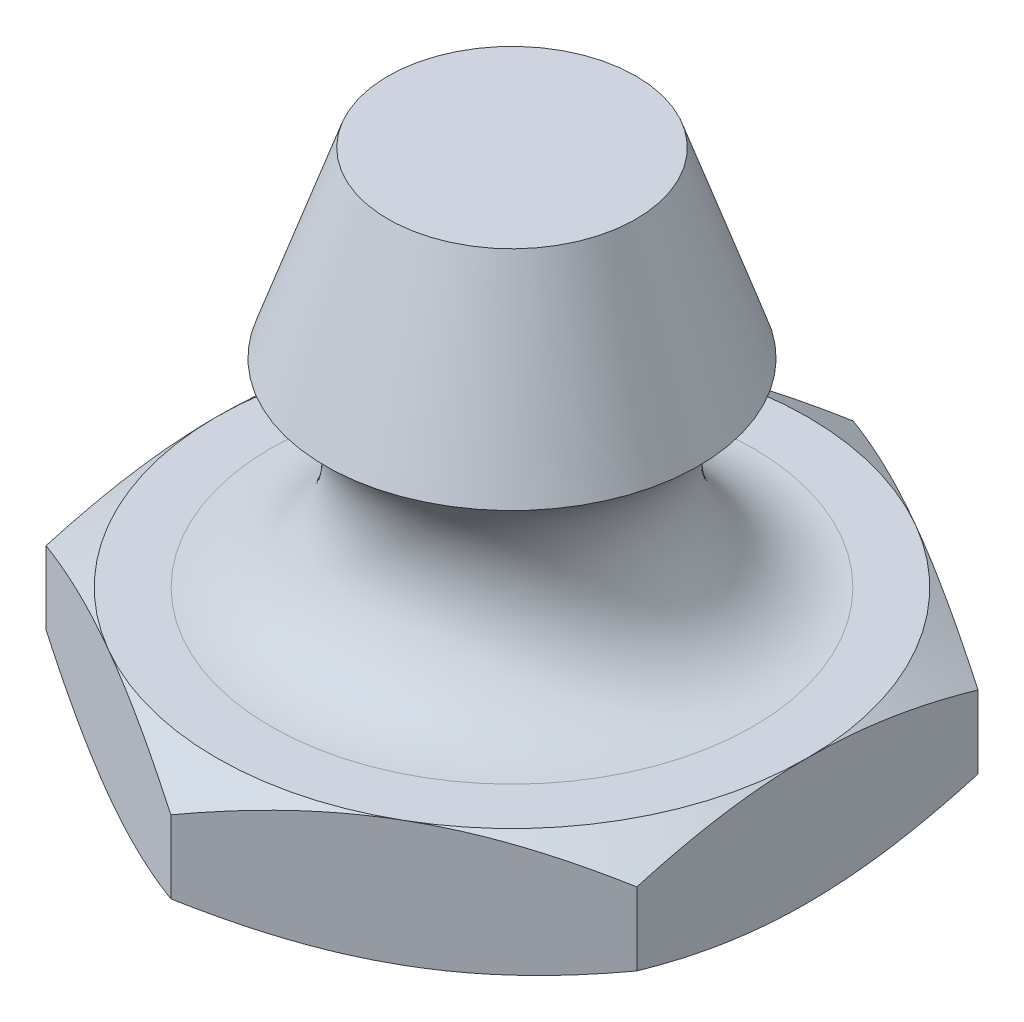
ISO-10303-21;
HEADER;
FILE_DESCRIPTION(('STEP AP214'),'2;1');
FILE_NAME('part.step','',(''),(''),'','','');
FILE_SCHEMA(('AUTOMOTIVE_DESIGN { 1 0 10303 214 1 1 1 1 }'));
ENDSEC;
DATA;
#1=APPLICATION_CONTEXT('core data for automotive mechanical design processes');
#2=APPLICATION_PROTOCOL_DEFINITION('international standard','automotive_design',2000,#1);
#3=PRODUCT_CONTEXT('',#1,'mechanical');
#4=PRODUCT('Part','Part','',(#3));
#5=PRODUCT_RELATED_PRODUCT_CATEGORY('part','',(#4));
#6=PRODUCT_DEFINITION_FORMATION('','',#4);
#7=PRODUCT_DEFINITION_CONTEXT('part definition',#1,'design');
#8=PRODUCT_DEFINITION('design','',#6,#7);
#9=PRODUCT_DEFINITION_SHAPE('','',#8);
#10=(LENGTH_UNIT() NAMED_UNIT(*) SI_UNIT(.MILLI.,.METRE.));
#11=(NAMED_UNIT(*) PLANE_ANGLE_UNIT() SI_UNIT($,.RADIAN.));
#12=(NAMED_UNIT(*) SI_UNIT($,.STERADIAN.) SOLID_ANGLE_UNIT());
#13=UNCERTAINTY_MEASURE_WITH_UNIT(LENGTH_MEASURE(1.E-05),#10,'distance_accuracy_value','');
#14=(GEOMETRIC_REPRESENTATION_CONTEXT(3) GLOBAL_UNCERTAINTY_ASSIGNED_CONTEXT((#13)) GLOBAL_UNIT_ASSIGNED_CONTEXT((#10,
#11,#12)) REPRESENTATION_CONTEXT('',''));
#15=CARTESIAN_POINT('',(0.,0.,0.));
#16=DIRECTION('',(0.,0.,1.));
#17=DIRECTION('',(1.,0.,0.));
#18=AXIS2_PLACEMENT_3D('',#15,#16,#17);
#19=CARTESIAN_POINT('',(-4.53389999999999,2.36220000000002,0.));
#20=DIRECTION('',(0.,1.,0.));
#21=DIRECTION('',(0.,0.,1.));
#22=AXIS2_PLACEMENT_3D('',#19,#20,#21);
#23=PLANE('',#22);
#24=CARTESIAN_POINT('',(0.,2.36220000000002,0.));
#25=DIRECTION('',(0.,1.,0.));
#26=DIRECTION('',(-1.,0.,0.));
#27=AXIS2_PLACEMENT_3D('',#24,#25,#26);
#28=CIRCLE('',#27,5.55625000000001);
#29=CARTESIAN_POINT('',(-5.55625000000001,2.36220000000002,0.));
#30=VERTEX_POINT('',#29);
#31=CARTESIAN_POINT('',(-2.778125,2.36220000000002,4.81185364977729));
#32=VERTEX_POINT('',#31);
#33=EDGE_CURVE('E124',#30,#32,#28,.T.);
#34=ORIENTED_EDGE('',*,*,#33,.T.);
#35=CARTESIAN_POINT('',(0.,2.36220000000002,0.));
#36=DIRECTION('',(0.,1.,0.));
#37=DIRECTION('',(0.,0.,1.));
#38=AXIS2_PLACEMENT_3D('',#35,#36,#37);
#39=CIRCLE('',#38,5.55625000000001);
#40=CARTESIAN_POINT('',(2.77812500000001,2.36220000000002,4.81185364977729));
#41=VERTEX_POINT('',#40);
#42=EDGE_CURVE('E138',#41,#32,#39,.F.);
#43=ORIENTED_EDGE('',*,*,#42,.F.);
#44=CARTESIAN_POINT('',(5.55625000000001,2.36220000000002,0.));
#45=VERTEX_POINT('',#44);
#46=EDGE_CURVE('E144',#45,#41,#39,.F.);
#47=ORIENTED_EDGE('',*,*,#46,.F.);
#48=CARTESIAN_POINT('',(2.77812500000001,2.36220000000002,-4.81185364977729));
#49=VERTEX_POINT('',#48);
#50=EDGE_CURVE('E506',#49,#45,#39,.F.);
#51=ORIENTED_EDGE('',*,*,#50,.F.);
#52=CARTESIAN_POINT('',(-2.778125,2.36220000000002,-4.81185364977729));
#53=VERTEX_POINT('',#52);
#54=EDGE_CURVE('E507',#53,#49,#39,.F.);
#55=ORIENTED_EDGE('',*,*,#54,.F.);
#56=EDGE_CURVE('E146',#30,#53,#39,.F.);
#57=ORIENTED_EDGE('',*,*,#56,.F.);
#58=EDGE_LOOP('',(#34,#43,#47,#51,#55,#57));
#59=FACE_BOUND('',#58,.T.);
#60=CARTESIAN_POINT('',(0.,2.36220000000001,0.));
#61=DIRECTION('',(0.,-1.,0.));
#62=DIRECTION('',(0.,0.,-1.));
#63=AXIS2_PLACEMENT_3D('',#60,#61,#62);
#64=CIRCLE('',#63,4.53389999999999);
#65=CARTESIAN_POINT('',(0.,2.36220000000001,-4.53389999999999));
#66=VERTEX_POINT('',#65);
#67=EDGE_CURVE('E328',#66,#66,#64,.T.);
#68=ORIENTED_EDGE('',*,*,#67,.T.);
#69=EDGE_LOOP('',(#68));
#70=FACE_BOUND('',#69,.T.);
#71=ADVANCED_FACE('F29',(#59,#70),#23,.T.);
#72=CARTESIAN_POINT('',(0.,6.09600000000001,0.));
#73=DIRECTION('',(0.,-1.,0.));
#74=DIRECTION('',(0.,0.,-1.));
#75=AXIS2_PLACEMENT_3D('',#72,#73,#74);
#76=CONICAL_SURFACE('',#75,3.51251676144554,0.331612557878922);
#77=CARTESIAN_POINT('',(0.,9.52500000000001,0.));
#78=DIRECTION('',(0.,-1.,0.));
#79=DIRECTION('',(0.,0.,-1.));
#80=AXIS2_PLACEMENT_3D('',#77,#78,#79);
#81=CIRCLE('',#80,2.33181737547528);
#82=CARTESIAN_POINT('',(0.,9.52500000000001,-2.33181737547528));
#83=VERTEX_POINT('',#82);
#84=EDGE_CURVE('E304',#83,#83,#81,.T.);
#85=ORIENTED_EDGE('',*,*,#84,.T.);
#86=EDGE_LOOP('',(#85));
#87=FACE_BOUND('',#86,.T.);
#88=CARTESIAN_POINT('',(0.,6.09600000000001,0.));
#89=DIRECTION('',(0.,-1.,0.));
#90=DIRECTION('',(0.,0.,-1.));
#91=AXIS2_PLACEMENT_3D('',#88,#89,#90);
#92=CIRCLE('',#91,3.51251676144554);
#93=CARTESIAN_POINT('',(0.,6.09600000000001,-3.51251676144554));
#94=VERTEX_POINT('',#93);
#95=EDGE_CURVE('E309',#94,#94,#92,.T.);
#96=ORIENTED_EDGE('',*,*,#95,.F.);
#97=EDGE_LOOP('',(#96));
#98=FACE_BOUND('',#97,.T.);
#99=ADVANCED_FACE('F261',(#87,#98),#76,.T.);
#100=CARTESIAN_POINT('',(0.,4.36880000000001,0.));
#101=DIRECTION('',(0.,-1.,0.));
#102=DIRECTION('',(0.,0.,-1.));
#103=AXIS2_PLACEMENT_3D('',#100,#101,#102);
#104=TOROIDAL_SURFACE('',#103,4.53389999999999,2.0066);
#105=ORIENTED_EDGE('',*,*,#95,.T.);
#106=EDGE_LOOP('',(#105));
#107=FACE_BOUND('',#106,.T.);
#108=ORIENTED_EDGE('',*,*,#67,.F.);
#109=EDGE_LOOP('',(#108));
#110=FACE_BOUND('',#109,.T.);
#111=ADVANCED_FACE('F265',(#107,#110),#104,.F.);
#112=CARTESIAN_POINT('',(0.,9.525,-6.41580486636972));
#113=DIRECTION('',(0.,-1.,0.));
#114=DIRECTION('',(0.,0.,-1.));
#115=AXIS2_PLACEMENT_3D('',#112,#113,#114);
#116=PLANE('',#115);
#117=ORIENTED_EDGE('',*,*,#84,.F.);
#118=EDGE_LOOP('',(#117));
#119=FACE_BOUND('',#118,.T.);
#120=ADVANCED_FACE('F183',(#119),#116,.F.);
#121=CARTESIAN_POINT('',(0.,1.18110000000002,0.));
#122=DIRECTION('',(0.,-1.,0.));
#123=DIRECTION('',(1.,0.,0.));
#124=AXIS2_PLACEMENT_3D('',#121,#122,#123);
#125=CONICAL_SURFACE('',#124,7.60197520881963,1.0471975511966);
#126=CARTESIAN_POINT('',(5.55645,1.86586909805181,3.20778696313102));
#127=CARTESIAN_POINT('',(5.43431700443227,1.90657443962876,3.27830048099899));
#128=CARTESIAN_POINT('',(5.31172863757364,1.94543246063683,3.34907690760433));
#129=CARTESIAN_POINT('',(5.06555635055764,2.01894506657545,3.49120454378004));
#130=CARTESIAN_POINT('',(4.94197202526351,2.05359783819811,3.56255598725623));
#131=CARTESIAN_POINT('',(4.56924027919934,2.1505681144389,3.7777527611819));
#132=CARTESIAN_POINT('',(4.3186215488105,2.20572394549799,3.92244755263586));
#133=CARTESIAN_POINT('',(3.94357517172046,2.27040109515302,4.13898067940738));
#134=CARTESIAN_POINT('',(3.82026814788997,2.28882582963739,4.21017202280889));
#135=CARTESIAN_POINT('',(3.57309692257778,2.31972163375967,4.35287639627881));
#136=CARTESIAN_POINT('',(3.44923277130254,2.33219322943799,4.42438939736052));
#137=CARTESIAN_POINT('',(3.20128932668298,2.35086491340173,4.56753961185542));
#138=CARTESIAN_POINT('',(3.07721043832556,2.35707211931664,4.63917659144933));
#139=CARTESIAN_POINT('',(2.82894487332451,2.36308858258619,4.7825127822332));
#140=CARTESIAN_POINT('',(2.70475820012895,2.36289803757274,4.85421199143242));
#141=CARTESIAN_POINT('',(2.36452243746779,2.35358175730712,5.05064720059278));
#142=CARTESIAN_POINT('',(2.14858470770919,2.33794034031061,5.1753189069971));
#143=CARTESIAN_POINT('',(1.71814349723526,2.28834009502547,5.42383425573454));
#144=CARTESIAN_POINT('',(1.50364153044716,2.25436431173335,5.54767702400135));
#145=CARTESIAN_POINT('',(1.07233397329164,2.16943424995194,5.79669255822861));
#146=CARTESIAN_POINT('',(0.855582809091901,2.1181201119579,5.92183390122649));
#147=CARTESIAN_POINT('',(0.42531295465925,2.00165754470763,6.17025031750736));
#148=CARTESIAN_POINT('',(0.211788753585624,1.93653647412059,6.29352857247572));
#149=CARTESIAN_POINT('',(-0.000199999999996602,1.86586909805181,6.41592033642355));
#150=B_SPLINE_CURVE_WITH_KNOTS('',3,(#126,#127,#128,#129,#130,#131,#132,#133,#134,#135,#136,
#137,#138,#139,#140,#141,#142,#143,#144,#145,#146,#147,#148,#149),.UNSPECIFIED.,.F.,.F.,(4,2,2,
2,2,2,2,2,2,2,2,4),(0.,0.44031690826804,0.880823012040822,1.76366572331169,2.19427472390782,
2.62484566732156,3.05492684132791,3.48499472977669,4.23370964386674,4.98311813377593,
5.74914806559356,6.51367405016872),.UNSPECIFIED.);
#151=CARTESIAN_POINT('',(0.,1.86593576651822,6.41580486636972));
#152=VERTEX_POINT('',#151);
#153=EDGE_CURVE('E133',#41,#152,#150,.T.);
#154=ORIENTED_EDGE('',*,*,#153,.F.);
#155=ORIENTED_EDGE('',*,*,#42,.T.);
#156=CARTESIAN_POINT('',(0.000200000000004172,1.86586909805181,6.41592033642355));
#157=CARTESIAN_POINT('',(-0.121932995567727,1.90657443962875,6.34540681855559));
#158=CARTESIAN_POINT('',(-0.244521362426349,1.94543246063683,6.27463039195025));
#159=CARTESIAN_POINT('',(-0.490693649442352,2.01894506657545,6.13250275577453));
#160=CARTESIAN_POINT('',(-0.614277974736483,2.05359783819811,6.06115131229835));
#161=CARTESIAN_POINT('',(-0.987009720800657,2.15056811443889,5.84595453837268));
#162=CARTESIAN_POINT('',(-1.2376284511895,2.20572394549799,5.70125974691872));
#163=CARTESIAN_POINT('',(-1.61267482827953,2.27040109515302,5.48472662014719));
#164=CARTESIAN_POINT('',(-1.73598185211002,2.28882582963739,5.41353527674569));
#165=CARTESIAN_POINT('',(-1.98315307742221,2.31972163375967,5.27083090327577));
#166=CARTESIAN_POINT('',(-2.10701722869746,2.33219322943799,5.19931790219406));
#167=CARTESIAN_POINT('',(-2.35496067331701,2.35086491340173,5.05616768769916));
#168=CARTESIAN_POINT('',(-2.47903956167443,2.35707211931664,4.98453070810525));
#169=CARTESIAN_POINT('',(-2.72730512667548,2.36308858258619,4.84119451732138));
#170=CARTESIAN_POINT('',(-2.85149179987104,2.36289803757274,4.76949530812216));
#171=CARTESIAN_POINT('',(-3.1917275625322,2.35358175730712,4.5730600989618));
#172=CARTESIAN_POINT('',(-3.4076652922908,2.33794034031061,4.44838839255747));
#173=CARTESIAN_POINT('',(-3.83810650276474,2.28834009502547,4.19987304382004));
#174=CARTESIAN_POINT('',(-4.05260846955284,2.25436431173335,4.07603027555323));
#175=CARTESIAN_POINT('',(-4.48391602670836,2.16943424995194,3.82701474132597));
#176=CARTESIAN_POINT('',(-4.7006671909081,2.1181201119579,3.70187339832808));
#177=CARTESIAN_POINT('',(-5.13093704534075,2.00165754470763,3.45345698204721));
#178=CARTESIAN_POINT('',(-5.34446124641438,1.93653647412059,3.33017872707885));
#179=CARTESIAN_POINT('',(-5.55645,1.86586909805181,3.20778696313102));
#180=B_SPLINE_CURVE_WITH_KNOTS('',3,(#156,#157,#158,#159,#160,#161,#162,#163,#164,#165,#166,
#167,#168,#169,#170,#171,#172,#173,#174,#175,#176,#177,#178,#179),.UNSPECIFIED.,.F.,.F.,(4,2,2,
2,2,2,2,2,2,2,2,4),(0.,0.440316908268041,0.880823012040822,1.76366572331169,2.19427472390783,
2.62484566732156,3.05492684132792,3.48499472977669,4.23370964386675,4.98311813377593,
5.74914806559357,6.51367405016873),.UNSPECIFIED.);
#181=EDGE_CURVE('E132',#152,#32,#180,.T.);
#182=ORIENTED_EDGE('',*,*,#181,.F.);
#183=EDGE_LOOP('',(#154,#155,#182));
#184=FACE_BOUND('',#183,.T.);
#185=ADVANCED_FACE('F139',(#184),#125,.T.);
#186=CARTESIAN_POINT('',(5.55625,-0.342785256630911,-8.60318594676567));
#187=CARTESIAN_POINT('',(5.55625,-0.225177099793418,-8.36062658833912));
#188=CARTESIAN_POINT('',(5.55625,-0.108700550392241,-8.11750895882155));
#189=CARTESIAN_POINT('',(5.55625,0.12135263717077,-7.629860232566));
#190=CARTESIAN_POINT('',(5.55625,0.234928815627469,-7.38532891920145));
#191=CARTESIAN_POINT('',(5.55625,0.459118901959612,-6.89328940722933));
#192=CARTESIAN_POINT('',(5.55625,0.569713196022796,-6.64577224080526));
#193=CARTESIAN_POINT('',(5.55625,0.786357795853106,-6.14876451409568));
#194=CARTESIAN_POINT('',(5.55625,0.892408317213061,-5.89927404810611));
#195=CARTESIAN_POINT('',(5.55625,1.10206229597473,-5.389912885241));
#196=CARTESIAN_POINT('',(5.55625,1.20547950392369,-5.12996510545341));
#197=CARTESIAN_POINT('',(5.55625,1.40445382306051,-4.60702320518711));
#198=CARTESIAN_POINT('',(5.55625,1.50001005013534,-4.34402874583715));
#199=CARTESIAN_POINT('',(5.55625,1.68074384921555,-3.81507188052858));
#200=CARTESIAN_POINT('',(5.55625,1.76594255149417,-3.54911676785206));
#201=CARTESIAN_POINT('',(5.55625,1.92321829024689,-3.01339151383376));
#202=CARTESIAN_POINT('',(5.55625,1.99529947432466,-2.74362260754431));
#203=CARTESIAN_POINT('',(5.55625,2.12248775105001,-2.20161703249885));
#204=CARTESIAN_POINT('',(5.55625,2.17768668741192,-1.92940232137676));
#205=CARTESIAN_POINT('',(5.55625,2.2679829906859,-1.38160175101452));
#206=CARTESIAN_POINT('',(5.55625,2.30308222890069,-1.10601620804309));
#207=CARTESIAN_POINT('',(5.55625,2.34991945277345,-0.556444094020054));
#208=CARTESIAN_POINT('',(5.55625,2.36195662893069,-0.282483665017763));
#209=CARTESIAN_POINT('',(5.55625,2.36243585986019,0.265479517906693));
#210=CARTESIAN_POINT('',(5.55625,2.35087745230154,0.539482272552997));
#211=CARTESIAN_POINT('',(5.55625,2.31200527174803,1.00506869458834));
#212=CARTESIAN_POINT('',(5.55625,2.29033635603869,1.19715191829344));
#213=CARTESIAN_POINT('',(5.55625,2.23675918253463,1.57989483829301));
#214=CARTESIAN_POINT('',(5.55625,2.20484952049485,1.77055433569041));
#215=CARTESIAN_POINT('',(5.55625,2.09543840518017,2.34015384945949));
#216=CARTESIAN_POINT('',(5.55625,2.00427532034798,2.71649799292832));
#217=CARTESIAN_POINT('',(5.55625,1.84642201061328,3.27920057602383));
#218=CARTESIAN_POINT('',(5.55625,1.78955934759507,3.46848184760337));
#219=CARTESIAN_POINT('',(5.55625,1.66998418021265,3.84520528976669));
#220=CARTESIAN_POINT('',(5.55625,1.6072716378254,4.03264744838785));
#221=CARTESIAN_POINT('',(5.55625,1.47699839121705,4.40575299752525));
#222=CARTESIAN_POINT('',(5.55625,1.40943932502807,4.5914169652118));
#223=CARTESIAN_POINT('',(5.55625,1.27026221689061,4.96121059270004));
#224=CARTESIAN_POINT('',(5.55625,1.19864421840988,5.14534026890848));
#225=CARTESIAN_POINT('',(5.55625,1.02760821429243,5.57333279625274));
#226=CARTESIAN_POINT('',(5.55624999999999,0.926874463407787,5.81666881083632));
#227=CARTESIAN_POINT('',(5.55624999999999,0.720643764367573,6.30131957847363));
#228=CARTESIAN_POINT('',(5.55624999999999,0.615146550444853,6.5426342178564));
#229=CARTESIAN_POINT('',(5.55624999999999,0.400327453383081,7.02360582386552));
#230=CARTESIAN_POINT('',(5.55624999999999,0.291004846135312,7.26326246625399));
#231=CARTESIAN_POINT('',(5.55624999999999,0.0692800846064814,7.74114905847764));
#232=CARTESIAN_POINT('',(5.55624999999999,-0.0431221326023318,7.97937897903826));
#233=CARTESIAN_POINT('',(5.55624999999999,-0.384280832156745,8.69272840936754));
#234=CARTESIAN_POINT('',(5.55624999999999,-0.616784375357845,9.16605479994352));
#235=CARTESIAN_POINT('',(5.55624999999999,-1.08859506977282,10.109303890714));
#236=CARTESIAN_POINT('',(5.55624999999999,-1.32790246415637,10.5792264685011));
#237=CARTESIAN_POINT('',(5.55624999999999,-1.68063526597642,11.2630783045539));
#238=CARTESIAN_POINT('',(5.55624999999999,-1.7921419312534,11.4780001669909));
#239=CARTESIAN_POINT('',(5.55624999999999,-2.01604656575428,11.9073742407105));
#240=CARTESIAN_POINT('',(5.55624999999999,-2.12844451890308,12.1218264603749));
#241=CARTESIAN_POINT('',(5.55624999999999,-2.46680547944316,12.7645907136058));
#242=CARTESIAN_POINT('',(5.55624999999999,-2.6939266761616,13.1922931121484));
#243=CARTESIAN_POINT('',(5.55624999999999,-3.14998046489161,14.0454110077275));
#244=CARTESIAN_POINT('',(5.55624999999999,-3.37890741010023,14.470829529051));
#245=CARTESIAN_POINT('',(5.55624999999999,-3.83861895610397,15.3206328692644));
#246=CARTESIAN_POINT('',(5.55624999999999,-4.06940345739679,15.7450177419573));
#247=CARTESIAN_POINT('',(5.55624999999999,-4.30088411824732,16.1690201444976));
#248=B_SPLINE_CURVE_WITH_KNOTS('',3,(#186,#187,#188,#189,#190,#191,#192,#193,#194,#195,#196,
#197,#198,#199,#200,#201,#202,#203,#204,#205,#206,#207,#208,#209,#210,#211,#212,#213,#214,#215,
#216,#217,#218,#219,#220,#221,#222,#223,#224,#225,#226,#227,#228,#229,#230,#231,#232,#233,#234,
#235,#236,#237,#238,#239,#240,#241,#242,#243,#244,#245,#246,#247),.UNSPECIFIED.,.F.,.F.,(4,2,2,
2,2,2,2,2,2,2,2,2,2,2,2,2,2,2,2,2,2,2,2,2,2,2,2,2,2,2,4),(0.,0.808712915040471,1.61755322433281,
2.43082017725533,3.24404849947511,4.0832426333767,4.92253102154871,5.76007738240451,
6.59735845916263,7.42999998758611,8.26256398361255,9.08425175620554,9.9059556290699,
10.4855789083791,11.0652817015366,12.2253379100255,12.8182022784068,13.4110705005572,
14.0037392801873,14.5964017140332,15.3864210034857,16.1764844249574,16.9666982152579,
17.7569281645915,19.3388788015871,20.9208860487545,21.6472632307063,22.3736273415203,
23.8264137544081,25.2757178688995,26.7249448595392),.UNSPECIFIED.);
#249=CARTESIAN_POINT('',(5.55625,1.86593576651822,3.20790243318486));
#250=VERTEX_POINT('',#249);
#251=EDGE_CURVE('E214',#45,#250,#248,.T.);
#252=ORIENTED_EDGE('',*,*,#251,.F.);
#253=ORIENTED_EDGE('',*,*,#46,.T.);
#254=EDGE_CURVE('E210',#250,#41,#150,.T.);
#255=ORIENTED_EDGE('',*,*,#254,.F.);
#256=EDGE_LOOP('',(#252,#253,#255));
#257=FACE_BOUND('',#256,.T.);
#258=ADVANCED_FACE('F182',(#257),#125,.T.);
#259=CARTESIAN_POINT('',(-0.000199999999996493,1.86586909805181,-6.41592033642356));
#260=CARTESIAN_POINT('',(0.121932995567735,1.90657443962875,-6.3454068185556));
#261=CARTESIAN_POINT('',(0.244521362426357,1.94543246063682,-6.27463039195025));
#262=CARTESIAN_POINT('',(0.49069364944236,2.01894506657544,-6.13250275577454));
#263=CARTESIAN_POINT('',(0.614277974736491,2.05359783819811,-6.06115131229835));
#264=CARTESIAN_POINT('',(0.987009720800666,2.15056811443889,-5.84595453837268));
#265=CARTESIAN_POINT('',(1.23762845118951,2.20572394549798,-5.70125974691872));
#266=CARTESIAN_POINT('',(1.61267482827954,2.27040109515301,-5.4847266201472));
#267=CARTESIAN_POINT('',(1.73598185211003,2.28882582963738,-5.41353527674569));
#268=CARTESIAN_POINT('',(1.98315307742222,2.31972163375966,-5.27083090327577));
#269=CARTESIAN_POINT('',(2.10701722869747,2.33219322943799,-5.19931790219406));
#270=CARTESIAN_POINT('',(2.35496067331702,2.35086491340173,-5.05616768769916));
#271=CARTESIAN_POINT('',(2.47903956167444,2.35707211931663,-4.98453070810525));
#272=CARTESIAN_POINT('',(2.72730512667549,2.36308858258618,-4.84119451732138));
#273=CARTESIAN_POINT('',(2.85149179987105,2.36289803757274,-4.76949530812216));
#274=CARTESIAN_POINT('',(3.19172756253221,2.35358175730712,-4.5730600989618));
#275=CARTESIAN_POINT('',(3.40766529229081,2.33794034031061,-4.44838839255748));
#276=CARTESIAN_POINT('',(3.83810650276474,2.28834009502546,-4.19987304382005));
#277=CARTESIAN_POINT('',(4.05260846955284,2.25436431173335,-4.07603027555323));
#278=CARTESIAN_POINT('',(4.48391602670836,2.16943424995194,-3.82701474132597));
#279=CARTESIAN_POINT('',(4.7006671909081,2.1181201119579,-3.70187339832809));
#280=CARTESIAN_POINT('',(5.13093704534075,2.00165754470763,-3.45345698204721));
#281=CARTESIAN_POINT('',(5.34446124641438,1.93653647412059,-3.33017872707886));
#282=CARTESIAN_POINT('',(5.55645,1.86586909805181,-3.20778696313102));
#283=B_SPLINE_CURVE_WITH_KNOTS('',3,(#259,#260,#261,#262,#263,#264,#265,#266,#267,#268,#269,
#270,#271,#272,#273,#274,#275,#276,#277,#278,#279,#280,#281,#282),.UNSPECIFIED.,.F.,.F.,(4,2,2,
2,2,2,2,2,2,2,2,4),(0.,0.440316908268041,0.880823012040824,1.76366572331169,2.19427472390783,
2.62484566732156,3.05492684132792,3.4849947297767,4.23370964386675,4.98311813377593,
5.74914806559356,6.51367405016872),.UNSPECIFIED.);
#284=CARTESIAN_POINT('',(5.55625,1.86593576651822,-3.20790243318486));
#285=VERTEX_POINT('',#284);
#286=EDGE_CURVE('E191',#49,#285,#283,.T.);
#287=ORIENTED_EDGE('',*,*,#286,.F.);
#288=ORIENTED_EDGE('',*,*,#50,.T.);
#289=EDGE_CURVE('E199',#285,#45,#248,.T.);
#290=ORIENTED_EDGE('',*,*,#289,.F.);
#291=EDGE_LOOP('',(#287,#288,#290));
#292=FACE_BOUND('',#291,.T.);
#293=ADVANCED_FACE('F184',(#292),#125,.T.);
#294=ORIENTED_EDGE('',*,*,#54,.T.);
#295=CARTESIAN_POINT('',(0.,1.86593576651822,-6.41580486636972));
#296=VERTEX_POINT('',#295);
#297=EDGE_CURVE('E298',#296,#49,#283,.T.);
#298=ORIENTED_EDGE('',*,*,#297,.F.);
#299=CARTESIAN_POINT('',(-5.55645000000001,1.86586909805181,-3.20778696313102));
#300=CARTESIAN_POINT('',(-5.43431700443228,1.90657443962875,-3.27830048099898));
#301=CARTESIAN_POINT('',(-5.31172863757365,1.94543246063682,-3.34907690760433));
#302=CARTESIAN_POINT('',(-5.06555635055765,2.01894506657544,-3.49120454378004));
#303=CARTESIAN_POINT('',(-4.94197202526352,2.05359783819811,-3.56255598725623));
#304=CARTESIAN_POINT('',(-4.56924027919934,2.15056811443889,-3.7777527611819));
#305=CARTESIAN_POINT('',(-4.3186215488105,2.20572394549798,-3.92244755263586));
#306=CARTESIAN_POINT('',(-3.94357517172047,2.27040109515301,-4.13898067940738));
#307=CARTESIAN_POINT('',(-3.82026814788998,2.28882582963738,-4.21017202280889));
#308=CARTESIAN_POINT('',(-3.57309692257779,2.31972163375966,-4.35287639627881));
#309=CARTESIAN_POINT('',(-3.44923277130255,2.33219322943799,-4.42438939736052));
#310=CARTESIAN_POINT('',(-3.20128932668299,2.35086491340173,-4.56753961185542));
#311=CARTESIAN_POINT('',(-3.07721043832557,2.35707211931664,-4.63917659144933));
#312=CARTESIAN_POINT('',(-2.82894487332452,2.36308858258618,-4.7825127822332));
#313=CARTESIAN_POINT('',(-2.70475820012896,2.36289803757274,-4.85421199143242));
#314=CARTESIAN_POINT('',(-2.3645224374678,2.35358175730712,-5.05064720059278));
#315=CARTESIAN_POINT('',(-2.1485847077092,2.33794034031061,-5.1753189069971));
#316=CARTESIAN_POINT('',(-1.71814349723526,2.28834009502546,-5.42383425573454));
#317=CARTESIAN_POINT('',(-1.50364153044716,2.25436431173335,-5.54767702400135));
#318=CARTESIAN_POINT('',(-1.07233397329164,2.16943424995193,-5.79669255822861));
#319=CARTESIAN_POINT('',(-0.855582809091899,2.1181201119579,-5.9218339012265));
#320=CARTESIAN_POINT('',(-0.425312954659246,2.00165754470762,-6.17025031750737));
#321=CARTESIAN_POINT('',(-0.211788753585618,1.93653647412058,-6.29352857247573));
#322=CARTESIAN_POINT('',(0.000200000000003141,1.86586909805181,-6.41592033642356));
#323=B_SPLINE_CURVE_WITH_KNOTS('',3,(#299,#300,#301,#302,#303,#304,#305,#306,#307,#308,#309,
#310,#311,#312,#313,#314,#315,#316,#317,#318,#319,#320,#321,#322),.UNSPECIFIED.,.F.,.F.,(4,2,2,
2,2,2,2,2,2,2,2,4),(0.,0.440316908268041,0.880823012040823,1.76366572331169,2.19427472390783,
2.62484566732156,3.05492684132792,3.4849947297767,4.23370964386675,4.98311813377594,
5.74914806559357,6.51367405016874),.UNSPECIFIED.);
#324=EDGE_CURVE('E206',#53,#296,#323,.T.);
#325=ORIENTED_EDGE('',*,*,#324,.F.);
#326=EDGE_LOOP('',(#294,#298,#325));
#327=FACE_BOUND('',#326,.T.);
#328=ADVANCED_FACE('F437',(#327),#125,.T.);
#329=ORIENTED_EDGE('',*,*,#56,.T.);
#330=CARTESIAN_POINT('',(-5.55625000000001,1.86593576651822,-3.20790243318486));
#331=VERTEX_POINT('',#330);
#332=EDGE_CURVE('E324',#331,#53,#323,.T.);
#333=ORIENTED_EDGE('',*,*,#332,.F.);
#334=CARTESIAN_POINT('',(-5.55625000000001,-0.342785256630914,-8.60318594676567));
#335=CARTESIAN_POINT('',(-5.55625000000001,-0.225177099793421,-8.36062658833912));
#336=CARTESIAN_POINT('',(-5.55625000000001,-0.108700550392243,-8.11750895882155));
#337=CARTESIAN_POINT('',(-5.55625000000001,0.121352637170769,-7.62986023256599));
#338=CARTESIAN_POINT('',(-5.55625000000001,0.234928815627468,-7.38532891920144));
#339=CARTESIAN_POINT('',(-5.55625000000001,0.45911890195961,-6.89328940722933));
#340=CARTESIAN_POINT('',(-5.55625000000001,0.569713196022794,-6.64577224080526));
#341=CARTESIAN_POINT('',(-5.55625000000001,0.786357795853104,-6.14876451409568));
#342=CARTESIAN_POINT('',(-5.55625000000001,0.892408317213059,-5.89927404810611));
#343=CARTESIAN_POINT('',(-5.55625000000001,1.10206229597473,-5.389912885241));
#344=CARTESIAN_POINT('',(-5.55625000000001,1.20547950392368,-5.12996510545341));
#345=CARTESIAN_POINT('',(-5.55625000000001,1.40445382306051,-4.6070232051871));
#346=CARTESIAN_POINT('',(-5.55625000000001,1.50001005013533,-4.34402874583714));
#347=CARTESIAN_POINT('',(-5.55625000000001,1.68074384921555,-3.81507188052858));
#348=CARTESIAN_POINT('',(-5.55625000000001,1.76594255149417,-3.54911676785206));
#349=CARTESIAN_POINT('',(-5.55625000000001,1.92321829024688,-3.01339151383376));
#350=CARTESIAN_POINT('',(-5.55625000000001,1.99529947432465,-2.7436226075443));
#351=CARTESIAN_POINT('',(-5.55625000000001,2.12248775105,-2.20161703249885));
#352=CARTESIAN_POINT('',(-5.55625000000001,2.17768668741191,-1.92940232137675));
#353=CARTESIAN_POINT('',(-5.55625000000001,2.2679829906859,-1.38160175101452));
#354=CARTESIAN_POINT('',(-5.55625000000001,2.30308222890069,-1.10601620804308));
#355=CARTESIAN_POINT('',(-5.55625000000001,2.34991945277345,-0.556444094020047));
#356=CARTESIAN_POINT('',(-5.55625000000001,2.36195662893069,-0.282483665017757));
#357=CARTESIAN_POINT('',(-5.55625000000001,2.36243585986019,0.2654795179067));
#358=CARTESIAN_POINT('',(-5.55625,2.35087745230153,0.539482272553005));
#359=CARTESIAN_POINT('',(-5.55625,2.31200527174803,1.00506869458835));
#360=CARTESIAN_POINT('',(-5.55625,2.29033635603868,1.19715191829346));
#361=CARTESIAN_POINT('',(-5.55625,2.23675918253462,1.57989483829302));
#362=CARTESIAN_POINT('',(-5.55625,2.20484952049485,1.77055433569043));
#363=CARTESIAN_POINT('',(-5.55625,2.09543840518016,2.3401538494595));
#364=CARTESIAN_POINT('',(-5.55625,2.00427532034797,2.71649799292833));
#365=CARTESIAN_POINT('',(-5.55625,1.84642201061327,3.27920057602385));
#366=CARTESIAN_POINT('',(-5.55625,1.78955934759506,3.46848184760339));
#367=CARTESIAN_POINT('',(-5.55625,1.66998418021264,3.84520528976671));
#368=CARTESIAN_POINT('',(-5.55625,1.60727163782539,4.03264744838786));
#369=CARTESIAN_POINT('',(-5.55625,1.47699839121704,4.40575299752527));
#370=CARTESIAN_POINT('',(-5.55625,1.40943932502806,4.59141696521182));
#371=CARTESIAN_POINT('',(-5.55625,1.2702622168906,4.96121059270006));
#372=CARTESIAN_POINT('',(-5.55625,1.19864421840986,5.1453402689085));
#373=CARTESIAN_POINT('',(-5.55625,1.02760821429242,5.57333279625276));
#374=CARTESIAN_POINT('',(-5.55625,0.926874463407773,5.81666881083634));
#375=CARTESIAN_POINT('',(-5.55625,0.72064376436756,6.30131957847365));
#376=CARTESIAN_POINT('',(-5.55625,0.615146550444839,6.54263421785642));
#377=CARTESIAN_POINT('',(-5.55625,0.400327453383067,7.02360582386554));
#378=CARTESIAN_POINT('',(-5.55625,0.291004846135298,7.26326246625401));
#379=CARTESIAN_POINT('',(-5.55625,0.0692800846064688,7.74114905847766));
#380=CARTESIAN_POINT('',(-5.55625,-0.0431221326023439,7.97937897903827));
#381=CARTESIAN_POINT('',(-5.55625,-0.384280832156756,8.69272840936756));
#382=CARTESIAN_POINT('',(-5.55625,-0.616784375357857,9.16605479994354));
#383=CARTESIAN_POINT('',(-5.55625,-1.08859506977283,10.109303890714));
#384=CARTESIAN_POINT('',(-5.55625,-1.32790246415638,10.5792264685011));
#385=CARTESIAN_POINT('',(-5.55625,-1.68063526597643,11.263078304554));
#386=CARTESIAN_POINT('',(-5.55625,-1.79214193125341,11.4780001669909));
#387=CARTESIAN_POINT('',(-5.55625,-2.01604656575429,11.9073742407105));
#388=CARTESIAN_POINT('',(-5.55625,-2.12844451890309,12.1218264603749));
#389=CARTESIAN_POINT('',(-5.55625,-2.46680547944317,12.7645907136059));
#390=CARTESIAN_POINT('',(-5.55625,-2.69392667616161,13.1922931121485));
#391=CARTESIAN_POINT('',(-5.55625,-3.14998046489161,14.0454110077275));
#392=CARTESIAN_POINT('',(-5.55625,-3.37890741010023,14.470829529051));
#393=CARTESIAN_POINT('',(-5.55625,-3.83861895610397,15.3206328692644));
#394=CARTESIAN_POINT('',(-5.55625,-4.06940345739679,15.7450177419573));
#395=CARTESIAN_POINT('',(-5.55625,-4.30088411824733,16.1690201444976));
#396=B_SPLINE_CURVE_WITH_KNOTS('',3,(#334,#335,#336,#337,#338,#339,#340,#341,#342,#343,#344,
#345,#346,#347,#348,#349,#350,#351,#352,#353,#354,#355,#356,#357,#358,#359,#360,#361,#362,#363,
#364,#365,#366,#367,#368,#369,#370,#371,#372,#373,#374,#375,#376,#377,#378,#379,#380,#381,#382,
#383,#384,#385,#386,#387,#388,#389,#390,#391,#392,#393,#394,#395),.UNSPECIFIED.,.F.,.F.,(4,2,2,
2,2,2,2,2,2,2,2,2,2,2,2,2,2,2,2,2,2,2,2,2,2,2,2,2,2,2,4),(0.,0.808712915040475,1.61755322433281,
2.43082017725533,3.24404849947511,4.0832426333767,4.92253102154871,5.76007738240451,
6.59735845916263,7.42999998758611,8.26256398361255,9.08425175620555,9.9059556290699,
10.4855789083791,11.0652817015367,12.2253379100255,12.8182022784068,13.4110705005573,
14.0037392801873,14.5964017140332,15.3864210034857,16.1764844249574,16.966698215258,
17.7569281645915,19.3388788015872,20.9208860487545,21.6472632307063,22.3736273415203,
23.8264137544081,25.2757178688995,26.7249448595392),.UNSPECIFIED.);
#397=EDGE_CURVE('E166',#30,#331,#396,.F.);
#398=ORIENTED_EDGE('',*,*,#397,.F.);
#399=EDGE_LOOP('',(#329,#333,#398));
#400=FACE_BOUND('',#399,.T.);
#401=ADVANCED_FACE('F292',(#400),#125,.T.);
#402=ORIENTED_EDGE('',*,*,#33,.F.);
#403=CARTESIAN_POINT('',(-5.55625,1.86593576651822,3.20790243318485));
#404=VERTEX_POINT('',#403);
#405=EDGE_CURVE('E127',#404,#30,#396,.F.);
#406=ORIENTED_EDGE('',*,*,#405,.F.);
#407=EDGE_CURVE('E120',#32,#404,#180,.T.);
#408=ORIENTED_EDGE('',*,*,#407,.F.);
#409=EDGE_LOOP('',(#402,#406,#408));
#410=FACE_BOUND('',#409,.T.);
#411=ADVANCED_FACE('F122',(#410),#125,.T.);
#412=CARTESIAN_POINT('',(5.55625,9.525,-3.20790243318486));
#413=DIRECTION('',(-0.500000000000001,0.,0.866025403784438));
#414=DIRECTION('',(0.866025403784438,0.,0.500000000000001));
#415=AXIS2_PLACEMENT_3D('',#412,#413,#414);
#416=PLANE('',#415);
#417=DIRECTION('',(0.,-1.,0.));
#418=VECTOR('',#417,1.);
#419=CARTESIAN_POINT('',(0.,9.525,-6.41580486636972));
#420=LINE('',#419,#418);
#421=CARTESIAN_POINT('',(0.,0.496264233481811,-6.41580486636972));
#422=VERTEX_POINT('',#421);
#423=EDGE_CURVE('E296',#296,#422,#420,.T.);
#424=ORIENTED_EDGE('',*,*,#423,.F.);
#425=ORIENTED_EDGE('',*,*,#297,.T.);
#426=ORIENTED_EDGE('',*,*,#286,.T.);
#427=DIRECTION('',(0.,-1.,0.));
#428=VECTOR('',#427,1.);
#429=CARTESIAN_POINT('',(5.55625,9.525,-3.20790243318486));
#430=LINE('',#429,#428);
#431=CARTESIAN_POINT('',(5.55625,0.496264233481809,-3.20790243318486));
#432=VERTEX_POINT('',#431);
#433=EDGE_CURVE('E303',#285,#432,#430,.T.);
#434=ORIENTED_EDGE('',*,*,#433,.T.);
#435=CARTESIAN_POINT('',(5.55645,0.496330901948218,-3.20778696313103));
#436=CARTESIAN_POINT('',(5.43431700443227,0.455625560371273,-3.27830048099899));
#437=CARTESIAN_POINT('',(5.31172863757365,0.4167675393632,-3.34907690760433));
#438=CARTESIAN_POINT('',(5.06555635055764,0.343254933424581,-3.49120454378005));
#439=CARTESIAN_POINT('',(4.94197202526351,0.308602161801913,-3.56255598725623));
#440=CARTESIAN_POINT('',(4.56924027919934,0.211631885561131,-3.7777527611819));
#441=CARTESIAN_POINT('',(4.3186215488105,0.156476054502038,-3.92244755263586));
#442=CARTESIAN_POINT('',(3.94357517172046,0.0917989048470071,-4.13898067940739));
#443=CARTESIAN_POINT('',(3.82026814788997,0.0733741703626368,-4.21017202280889));
#444=CARTESIAN_POINT('',(3.57309692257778,0.0424783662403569,-4.35287639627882));
#445=CARTESIAN_POINT('',(3.44923277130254,0.0300067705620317,-4.42438939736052));
#446=CARTESIAN_POINT('',(3.20128932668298,0.011335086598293,-4.56753961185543));
#447=CARTESIAN_POINT('',(3.07721043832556,0.00512788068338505,-4.63917659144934));
#448=CARTESIAN_POINT('',(2.82894487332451,-0.000888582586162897,-4.78251278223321));
#449=CARTESIAN_POINT('',(2.70475820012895,-0.000698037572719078,-4.85421199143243));
#450=CARTESIAN_POINT('',(2.36452243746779,0.00861824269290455,-5.05064720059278));
#451=CARTESIAN_POINT('',(2.14858470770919,0.0242596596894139,-5.17531890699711));
#452=CARTESIAN_POINT('',(1.71814349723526,0.0738599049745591,-5.42383425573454));
#453=CARTESIAN_POINT('',(1.50364153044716,0.107835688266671,-5.54767702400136));
#454=CARTESIAN_POINT('',(1.07233397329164,0.19276575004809,-5.79669255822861));
#455=CARTESIAN_POINT('',(0.855582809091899,0.244079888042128,-5.9218339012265));
#456=CARTESIAN_POINT('',(0.42531295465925,0.360542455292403,-6.17025031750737));
#457=CARTESIAN_POINT('',(0.211788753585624,0.425663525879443,-6.29352857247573));
#458=CARTESIAN_POINT('',(-0.000199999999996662,0.49633090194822,-6.41592033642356));
#459=B_SPLINE_CURVE_WITH_KNOTS('',3,(#435,#436,#437,#438,#439,#440,#441,#442,#443,#444,#445,
#446,#447,#448,#449,#450,#451,#452,#453,#454,#455,#456,#457,#458),.UNSPECIFIED.,.F.,.F.,(4,2,2,
2,2,2,2,2,2,2,2,4),(0.,0.440316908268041,0.880823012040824,1.76366572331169,2.19427472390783,
2.62484566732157,3.05492684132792,3.4849947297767,4.23370964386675,4.98311813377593,
5.74914806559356,6.51367405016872),.UNSPECIFIED.);
#460=CARTESIAN_POINT('',(2.77812500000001,0.,-4.81185364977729));
#461=VERTEX_POINT('',#460);
#462=EDGE_CURVE('E158',#432,#461,#459,.T.);
#463=ORIENTED_EDGE('',*,*,#462,.T.);
#464=EDGE_CURVE('E156',#461,#422,#459,.T.);
#465=ORIENTED_EDGE('',*,*,#464,.T.);
#466=EDGE_LOOP('',(#424,#425,#426,#434,#463,#465));
#467=FACE_BOUND('',#466,.T.);
#468=ADVANCED_FACE('F282',(#467),#416,.F.);
#469=CARTESIAN_POINT('',(5.55625,9.525,3.20790243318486));
#470=DIRECTION('',(-1.,0.,0.));
#471=DIRECTION('',(0.,0.,1.));
#472=AXIS2_PLACEMENT_3D('',#469,#470,#471);
#473=PLANE('',#472);
#474=ORIENTED_EDGE('',*,*,#433,.F.);
#475=ORIENTED_EDGE('',*,*,#289,.T.);
#476=ORIENTED_EDGE('',*,*,#251,.T.);
#477=DIRECTION('',(0.,-1.,0.));
#478=VECTOR('',#477,1.);
#479=CARTESIAN_POINT('',(5.55625,9.525,3.20790243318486));
#480=LINE('',#479,#478);
#481=CARTESIAN_POINT('',(5.55625,0.496264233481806,3.20790243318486));
#482=VERTEX_POINT('',#481);
#483=EDGE_CURVE('E307',#250,#482,#480,.T.);
#484=ORIENTED_EDGE('',*,*,#483,.T.);
#485=CARTESIAN_POINT('',(5.55625,2.70498525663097,-8.60318594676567));
#486=CARTESIAN_POINT('',(5.55625,2.58737709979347,-8.36062658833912));
#487=CARTESIAN_POINT('',(5.55625,2.4709005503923,-8.11750895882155));
#488=CARTESIAN_POINT('',(5.55625,2.24084736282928,-7.629860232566));
#489=CARTESIAN_POINT('',(5.55625,2.12727118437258,-7.38532891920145));
#490=CARTESIAN_POINT('',(5.55625,1.90308109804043,-6.89328940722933));
#491=CARTESIAN_POINT('',(5.55625,1.79248680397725,-6.64577224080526));
#492=CARTESIAN_POINT('',(5.55625,1.57584220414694,-6.14876451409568));
#493=CARTESIAN_POINT('',(5.55625,1.46979168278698,-5.89927404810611));
#494=CARTESIAN_POINT('',(5.55625,1.26013770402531,-5.389912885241));
#495=CARTESIAN_POINT('',(5.55625,1.15672049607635,-5.12996510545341));
#496=CARTESIAN_POINT('',(5.55625,0.957746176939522,-4.60702320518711));
#497=CARTESIAN_POINT('',(5.55625,0.862189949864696,-4.34402874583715));
#498=CARTESIAN_POINT('',(5.55625,0.681456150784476,-3.81507188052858));
#499=CARTESIAN_POINT('',(5.55625,0.596257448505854,-3.54911676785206));
#500=CARTESIAN_POINT('',(5.55625,0.438981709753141,-3.01339151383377));
#501=CARTESIAN_POINT('',(5.55625,0.36690052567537,-2.74362260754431));
#502=CARTESIAN_POINT('',(5.55625,0.239712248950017,-2.20161703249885));
#503=CARTESIAN_POINT('',(5.55625,0.184513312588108,-1.92940232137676));
#504=CARTESIAN_POINT('',(5.55625,0.0942170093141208,-1.38160175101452));
#505=CARTESIAN_POINT('',(5.55625,0.0591177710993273,-1.10601620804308));
#506=CARTESIAN_POINT('',(5.55625,0.0122805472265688,-0.556444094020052));
#507=CARTESIAN_POINT('',(5.55625,0.000243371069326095,-0.282483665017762));
#508=CARTESIAN_POINT('',(5.55625,-0.00023585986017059,0.265479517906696));
#509=CARTESIAN_POINT('',(5.55625,0.0113225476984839,0.539482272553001));
#510=CARTESIAN_POINT('',(5.55625,0.0501947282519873,1.00506869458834));
#511=CARTESIAN_POINT('',(5.55625,0.0718636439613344,1.19715191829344));
#512=CARTESIAN_POINT('',(5.55625,0.12544081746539,1.579894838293));
#513=CARTESIAN_POINT('',(5.55625,0.157350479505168,1.7705543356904));
#514=CARTESIAN_POINT('',(5.55625,0.266761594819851,2.34015384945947));
#515=CARTESIAN_POINT('',(5.55625,0.35792467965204,2.71649799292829));
#516=CARTESIAN_POINT('',(5.55625,0.515777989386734,3.2792005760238));
#517=CARTESIAN_POINT('',(5.55625,0.57264065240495,3.46848184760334));
#518=CARTESIAN_POINT('',(5.55625,0.692215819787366,3.84520528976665));
#519=CARTESIAN_POINT('',(5.55625,0.754928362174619,4.0326474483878));
#520=CARTESIAN_POINT('',(5.55625,0.885201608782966,4.4057529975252));
#521=CARTESIAN_POINT('',(5.55625,0.952760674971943,4.59141696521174));
#522=CARTESIAN_POINT('',(5.55625,1.0919377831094,4.96121059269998));
#523=CARTESIAN_POINT('',(5.55625,1.16355578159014,5.14534026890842));
#524=CARTESIAN_POINT('',(5.55625,1.33459178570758,5.57333279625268));
#525=CARTESIAN_POINT('',(5.55624999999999,1.43532553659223,5.81666881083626));
#526=CARTESIAN_POINT('',(5.55624999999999,1.64155623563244,6.30131957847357));
#527=CARTESIAN_POINT('',(5.55624999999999,1.74705344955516,6.54263421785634));
#528=CARTESIAN_POINT('',(5.55624999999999,1.96187254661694,7.02360582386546));
#529=CARTESIAN_POINT('',(5.55624999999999,2.07119515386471,7.26326246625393));
#530=CARTESIAN_POINT('',(5.55624999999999,2.29291991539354,7.74114905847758));
#531=CARTESIAN_POINT('',(5.55624999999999,2.40532213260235,7.97937897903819));
#532=CARTESIAN_POINT('',(5.55624999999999,2.74648083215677,8.69272840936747));
#533=CARTESIAN_POINT('',(5.55624999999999,2.97898437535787,9.16605479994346));
#534=CARTESIAN_POINT('',(5.55624999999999,3.45079506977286,10.1093038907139));
#535=CARTESIAN_POINT('',(5.55624999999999,3.69010246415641,10.5792264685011));
#536=CARTESIAN_POINT('',(5.55624999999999,4.04283526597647,11.2630783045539));
#537=CARTESIAN_POINT('',(5.55624999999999,4.15434193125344,11.4780001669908));
#538=CARTESIAN_POINT('',(5.55624999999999,4.37824656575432,11.9073742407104));
#539=CARTESIAN_POINT('',(5.55624999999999,4.49064451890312,12.1218264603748));
#540=CARTESIAN_POINT('',(5.55624999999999,4.82900547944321,12.7645907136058));
#541=CARTESIAN_POINT('',(5.55624999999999,5.05612667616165,13.1922931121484));
#542=CARTESIAN_POINT('',(5.55624999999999,5.51218046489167,14.0454110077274));
#543=CARTESIAN_POINT('',(5.55624999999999,5.74110741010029,14.470829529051));
#544=CARTESIAN_POINT('',(5.55624999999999,6.20081895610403,15.3206328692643));
#545=CARTESIAN_POINT('',(5.55624999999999,6.43160345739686,15.7450177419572));
#546=CARTESIAN_POINT('',(5.55624999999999,6.66308411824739,16.1690201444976));
#547=B_SPLINE_CURVE_WITH_KNOTS('',3,(#485,#486,#487,#488,#489,#490,#491,#492,#493,#494,#495,
#496,#497,#498,#499,#500,#501,#502,#503,#504,#505,#506,#507,#508,#509,#510,#511,#512,#513,#514,
#515,#516,#517,#518,#519,#520,#521,#522,#523,#524,#525,#526,#527,#528,#529,#530,#531,#532,#533,
#534,#535,#536,#537,#538,#539,#540,#541,#542,#543,#544,#545,#546),.UNSPECIFIED.,.F.,.F.,(4,2,2,
2,2,2,2,2,2,2,2,2,2,2,2,2,2,2,2,2,2,2,2,2,2,2,2,2,2,2,4),(0.,0.808712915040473,1.61755322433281,
2.43082017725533,3.24404849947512,4.08324263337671,4.92253102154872,5.76007738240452,
6.59735845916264,7.42999998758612,8.26256398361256,9.08425175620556,9.90595562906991,
10.4855789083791,11.0652817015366,12.2253379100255,12.8182022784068,13.4110705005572,
14.0037392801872,14.5964017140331,15.3864210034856,16.1764844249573,16.9666982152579,
17.7569281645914,19.3388788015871,20.9208860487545,21.6472632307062,22.3736273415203,
23.8264137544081,25.2757178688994,26.7249448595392),.UNSPECIFIED.);
#548=CARTESIAN_POINT('',(5.55625000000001,0.,0.));
#549=VERTEX_POINT('',#548);
#550=EDGE_CURVE('E230',#482,#549,#547,.F.);
#551=ORIENTED_EDGE('',*,*,#550,.T.);
#552=EDGE_CURVE('E231',#549,#432,#547,.F.);
#553=ORIENTED_EDGE('',*,*,#552,.T.);
#554=EDGE_LOOP('',(#474,#475,#476,#484,#551,#553));
#555=FACE_BOUND('',#554,.T.);
#556=ADVANCED_FACE('F218',(#555),#473,.F.);
#557=CARTESIAN_POINT('',(0.,9.525,6.41580486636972));
#558=DIRECTION('',(-0.5,0.,-0.866025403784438));
#559=DIRECTION('',(-0.866025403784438,0.,0.5));
#560=AXIS2_PLACEMENT_3D('',#557,#558,#559);
#561=PLANE('',#560);
#562=ORIENTED_EDGE('',*,*,#483,.F.);
#563=ORIENTED_EDGE('',*,*,#254,.T.);
#564=ORIENTED_EDGE('',*,*,#153,.T.);
#565=DIRECTION('',(0.,-1.,0.));
#566=VECTOR('',#565,1.);
#567=CARTESIAN_POINT('',(0.,9.525,6.41580486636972));
#568=LINE('',#567,#566);
#569=CARTESIAN_POINT('',(0.,0.496264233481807,6.41580486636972));
#570=VERTEX_POINT('',#569);
#571=EDGE_CURVE('E155',#152,#570,#568,.T.);
#572=ORIENTED_EDGE('',*,*,#571,.T.);
#573=CARTESIAN_POINT('',(-0.000199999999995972,0.496330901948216,6.41592033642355));
#574=CARTESIAN_POINT('',(0.121932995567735,0.455625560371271,6.34540681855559));
#575=CARTESIAN_POINT('',(0.244521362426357,0.416767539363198,6.27463039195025));
#576=CARTESIAN_POINT('',(0.49069364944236,0.34325493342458,6.13250275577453));
#577=CARTESIAN_POINT('',(0.614277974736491,0.308602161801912,6.06115131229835));
#578=CARTESIAN_POINT('',(0.987009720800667,0.211631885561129,5.84595453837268));
#579=CARTESIAN_POINT('',(1.23762845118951,0.156476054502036,5.70125974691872));
#580=CARTESIAN_POINT('',(1.61267482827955,0.091798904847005,5.48472662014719));
#581=CARTESIAN_POINT('',(1.73598185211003,0.0733741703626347,5.41353527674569));
#582=CARTESIAN_POINT('',(1.98315307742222,0.0424783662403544,5.27083090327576));
#583=CARTESIAN_POINT('',(2.10701722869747,0.0300067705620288,5.19931790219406));
#584=CARTESIAN_POINT('',(2.35496067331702,0.0113350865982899,5.05616768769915));
#585=CARTESIAN_POINT('',(2.47903956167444,0.00512788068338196,4.98453070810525));
#586=CARTESIAN_POINT('',(2.7273051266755,-0.000888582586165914,4.84119451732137));
#587=CARTESIAN_POINT('',(2.85149179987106,-0.000698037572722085,4.76949530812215));
#588=CARTESIAN_POINT('',(3.19172756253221,0.00861824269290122,4.5730600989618));
#589=CARTESIAN_POINT('',(3.40766529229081,0.02425965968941,4.44838839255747));
#590=CARTESIAN_POINT('',(3.83810650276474,0.073859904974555,4.19987304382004));
#591=CARTESIAN_POINT('',(4.05260846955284,0.107835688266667,4.07603027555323));
#592=CARTESIAN_POINT('',(4.48391602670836,0.192765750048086,3.82701474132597));
#593=CARTESIAN_POINT('',(4.7006671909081,0.244079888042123,3.70187339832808));
#594=CARTESIAN_POINT('',(5.13093704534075,0.360542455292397,3.45345698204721));
#595=CARTESIAN_POINT('',(5.34446124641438,0.425663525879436,3.33017872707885));
#596=CARTESIAN_POINT('',(5.55645,0.496330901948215,3.20778696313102));
#597=B_SPLINE_CURVE_WITH_KNOTS('',3,(#573,#574,#575,#576,#577,#578,#579,#580,#581,#582,#583,
#584,#585,#586,#587,#588,#589,#590,#591,#592,#593,#594,#595,#596),.UNSPECIFIED.,.F.,.F.,(4,2,2,
2,2,2,2,2,2,2,2,4),(0.,0.440316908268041,0.880823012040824,1.76366572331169,2.19427472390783,
2.62484566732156,3.05492684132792,3.4849947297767,4.23370964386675,4.98311813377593,
5.74914806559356,6.51367405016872),.UNSPECIFIED.);
#598=CARTESIAN_POINT('',(2.77812500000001,0.,4.81185364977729));
#599=VERTEX_POINT('',#598);
#600=EDGE_CURVE('E229',#570,#599,#597,.T.);
#601=ORIENTED_EDGE('',*,*,#600,.T.);
#602=EDGE_CURVE('E223',#599,#482,#597,.T.);
#603=ORIENTED_EDGE('',*,*,#602,.T.);
#604=EDGE_LOOP('',(#562,#563,#564,#572,#601,#603));
#605=FACE_BOUND('',#604,.T.);
#606=ADVANCED_FACE('F215',(#605),#561,.F.);
#607=CARTESIAN_POINT('',(-5.55625,9.525,3.20790243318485));
#608=DIRECTION('',(0.5,0.,-0.866025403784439));
#609=DIRECTION('',(-0.866025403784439,0.,-0.5));
#610=AXIS2_PLACEMENT_3D('',#607,#608,#609);
#611=PLANE('',#610);
#612=ORIENTED_EDGE('',*,*,#571,.F.);
#613=ORIENTED_EDGE('',*,*,#181,.T.);
#614=ORIENTED_EDGE('',*,*,#407,.T.);
#615=DIRECTION('',(0.,-1.,0.));
#616=VECTOR('',#615,1.);
#617=CARTESIAN_POINT('',(-5.55625,9.525,3.20790243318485));
#618=LINE('',#617,#616);
#619=CARTESIAN_POINT('',(-5.55625,0.496264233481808,3.20790243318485));
#620=VERTEX_POINT('',#619);
#621=EDGE_CURVE('E316',#404,#620,#618,.T.);
#622=ORIENTED_EDGE('',*,*,#621,.T.);
#623=CARTESIAN_POINT('',(-5.55645,0.496330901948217,3.20778696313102));
#624=CARTESIAN_POINT('',(-5.43431700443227,0.455625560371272,3.27830048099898));
#625=CARTESIAN_POINT('',(-5.31172863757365,0.416767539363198,3.34907690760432));
#626=CARTESIAN_POINT('',(-5.06555635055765,0.34325493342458,3.49120454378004));
#627=CARTESIAN_POINT('',(-4.94197202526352,0.308602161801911,3.56255598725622));
#628=CARTESIAN_POINT('',(-4.56924027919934,0.211631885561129,3.77775276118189));
#629=CARTESIAN_POINT('',(-4.3186215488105,0.156476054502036,3.92244755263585));
#630=CARTESIAN_POINT('',(-3.94357517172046,0.0917989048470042,4.13898067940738));
#631=CARTESIAN_POINT('',(-3.82026814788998,0.0733741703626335,4.21017202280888));
#632=CARTESIAN_POINT('',(-3.57309692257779,0.0424783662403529,4.35287639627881));
#633=CARTESIAN_POINT('',(-3.44923277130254,0.0300067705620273,4.42438939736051));
#634=CARTESIAN_POINT('',(-3.20128932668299,0.0113350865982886,4.56753961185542));
#635=CARTESIAN_POINT('',(-3.07721043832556,0.00512788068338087,4.63917659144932));
#636=CARTESIAN_POINT('',(-2.82894487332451,-0.000888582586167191,4.7825127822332));
#637=CARTESIAN_POINT('',(-2.70475820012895,-0.000698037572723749,4.85421199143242));
#638=CARTESIAN_POINT('',(-2.36452243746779,0.00861824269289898,5.05064720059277));
#639=CARTESIAN_POINT('',(-2.14858470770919,0.024259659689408,5.1753189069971));
#640=CARTESIAN_POINT('',(-1.71814349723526,0.0738599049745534,5.42383425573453));
#641=CARTESIAN_POINT('',(-1.50364153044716,0.107835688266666,5.54767702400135));
#642=CARTESIAN_POINT('',(-1.07233397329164,0.192765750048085,5.7966925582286));
#643=CARTESIAN_POINT('',(-0.855582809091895,0.244079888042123,5.92183390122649));
#644=CARTESIAN_POINT('',(-0.425312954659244,0.360542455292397,6.17025031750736));
#645=CARTESIAN_POINT('',(-0.211788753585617,0.425663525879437,6.29352857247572));
#646=CARTESIAN_POINT('',(0.000200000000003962,0.496330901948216,6.41592033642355));
#647=B_SPLINE_CURVE_WITH_KNOTS('',3,(#623,#624,#625,#626,#627,#628,#629,#630,#631,#632,#633,
#634,#635,#636,#637,#638,#639,#640,#641,#642,#643,#644,#645,#646),.UNSPECIFIED.,.F.,.F.,(4,2,2,
2,2,2,2,2,2,2,2,4),(0.,0.440316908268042,0.880823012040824,1.76366572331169,2.19427472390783,
2.62484566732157,3.05492684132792,3.4849947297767,4.23370964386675,4.98311813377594,
5.74914806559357,6.51367405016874),.UNSPECIFIED.);
#648=CARTESIAN_POINT('',(-2.778125,0.,4.81185364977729));
#649=VERTEX_POINT('',#648);
#650=EDGE_CURVE('E239',#620,#649,#647,.T.);
#651=ORIENTED_EDGE('',*,*,#650,.T.);
#652=EDGE_CURVE('E53',#649,#570,#647,.T.);
#653=ORIENTED_EDGE('',*,*,#652,.T.);
#654=EDGE_LOOP('',(#612,#613,#614,#622,#651,#653));
#655=FACE_BOUND('',#654,.T.);
#656=ADVANCED_FACE('F153',(#655),#611,.F.);
#657=CARTESIAN_POINT('',(-5.55625000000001,9.525,-3.20790243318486));
#658=DIRECTION('',(1.,0.,0.));
#659=DIRECTION('',(0.,0.,-1.));
#660=AXIS2_PLACEMENT_3D('',#657,#658,#659);
#661=PLANE('',#660);
#662=ORIENTED_EDGE('',*,*,#621,.F.);
#663=ORIENTED_EDGE('',*,*,#405,.T.);
#664=ORIENTED_EDGE('',*,*,#397,.T.);
#665=DIRECTION('',(0.,-1.,0.));
#666=VECTOR('',#665,1.);
#667=CARTESIAN_POINT('',(-5.55625000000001,9.525,-3.20790243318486));
#668=LINE('',#667,#666);
#669=CARTESIAN_POINT('',(-5.55625000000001,0.49626423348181,-3.20790243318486));
#670=VERTEX_POINT('',#669);
#671=EDGE_CURVE('E145',#331,#670,#668,.T.);
#672=ORIENTED_EDGE('',*,*,#671,.T.);
#673=CARTESIAN_POINT('',(-5.55625000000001,2.70498525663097,-8.60318594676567));
#674=CARTESIAN_POINT('',(-5.55625000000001,2.58737709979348,-8.36062658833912));
#675=CARTESIAN_POINT('',(-5.55625000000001,2.4709005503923,-8.11750895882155));
#676=CARTESIAN_POINT('',(-5.55625000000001,2.24084736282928,-7.629860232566));
#677=CARTESIAN_POINT('',(-5.55625000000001,2.12727118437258,-7.38532891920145));
#678=CARTESIAN_POINT('',(-5.55625000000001,1.90308109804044,-6.89328940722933));
#679=CARTESIAN_POINT('',(-5.55625000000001,1.79248680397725,-6.64577224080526));
#680=CARTESIAN_POINT('',(-5.55625000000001,1.57584220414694,-6.14876451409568));
#681=CARTESIAN_POINT('',(-5.55625000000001,1.46979168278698,-5.89927404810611));
#682=CARTESIAN_POINT('',(-5.55625000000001,1.26013770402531,-5.38991288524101));
#683=CARTESIAN_POINT('',(-5.55625000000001,1.15672049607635,-5.12996510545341));
#684=CARTESIAN_POINT('',(-5.55625000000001,0.957746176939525,-4.60702320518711));
#685=CARTESIAN_POINT('',(-5.55625000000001,0.862189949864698,-4.34402874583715));
#686=CARTESIAN_POINT('',(-5.55625000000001,0.681456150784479,-3.81507188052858));
#687=CARTESIAN_POINT('',(-5.55625000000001,0.596257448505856,-3.54911676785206));
#688=CARTESIAN_POINT('',(-5.55625000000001,0.438981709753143,-3.01339151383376));
#689=CARTESIAN_POINT('',(-5.55625000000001,0.366900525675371,-2.7436226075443));
#690=CARTESIAN_POINT('',(-5.55625000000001,0.239712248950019,-2.20161703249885));
#691=CARTESIAN_POINT('',(-5.55625000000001,0.184513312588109,-1.92940232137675));
#692=CARTESIAN_POINT('',(-5.55625000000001,0.0942170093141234,-1.38160175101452));
#693=CARTESIAN_POINT('',(-5.55625000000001,0.0591177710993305,-1.10601620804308));
#694=CARTESIAN_POINT('',(-5.55625000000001,0.0122805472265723,-0.556444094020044));
#695=CARTESIAN_POINT('',(-5.55625000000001,0.000243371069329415,-0.282483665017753));
#696=CARTESIAN_POINT('',(-5.55625000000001,-0.000235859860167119,0.265479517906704));
#697=CARTESIAN_POINT('',(-5.55625,0.0113225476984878,0.53948227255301));
#698=CARTESIAN_POINT('',(-5.55625,0.0501947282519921,1.00506869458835));
#699=CARTESIAN_POINT('',(-5.55625,0.0718636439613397,1.19715191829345));
#700=CARTESIAN_POINT('',(-5.55625,0.125440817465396,1.57989483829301));
#701=CARTESIAN_POINT('',(-5.55625,0.157350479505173,1.77055433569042));
#702=CARTESIAN_POINT('',(-5.55625,0.266761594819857,2.34015384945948));
#703=CARTESIAN_POINT('',(-5.55625,0.357924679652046,2.71649799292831));
#704=CARTESIAN_POINT('',(-5.55625,0.515777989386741,3.27920057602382));
#705=CARTESIAN_POINT('',(-5.55625,0.572640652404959,3.46848184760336));
#706=CARTESIAN_POINT('',(-5.55625,0.692215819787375,3.84520528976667));
#707=CARTESIAN_POINT('',(-5.55625,0.754928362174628,4.03264744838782));
#708=CARTESIAN_POINT('',(-5.55625,0.885201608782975,4.40575299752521));
#709=CARTESIAN_POINT('',(-5.55625,0.952760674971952,4.59141696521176));
#710=CARTESIAN_POINT('',(-5.55625,1.09193778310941,4.9612105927));
#711=CARTESIAN_POINT('',(-5.55625,1.16355578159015,5.14534026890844));
#712=CARTESIAN_POINT('',(-5.55625,1.33459178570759,5.5733327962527));
#713=CARTESIAN_POINT('',(-5.55625,1.43532553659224,5.81666881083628));
#714=CARTESIAN_POINT('',(-5.55625,1.64155623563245,6.30131957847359));
#715=CARTESIAN_POINT('',(-5.55625,1.74705344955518,6.54263421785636));
#716=CARTESIAN_POINT('',(-5.55625,1.96187254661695,7.02360582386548));
#717=CARTESIAN_POINT('',(-5.55625,2.07119515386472,7.26326246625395));
#718=CARTESIAN_POINT('',(-5.55625,2.29291991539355,7.7411490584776));
#719=CARTESIAN_POINT('',(-5.55625,2.40532213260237,7.97937897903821));
#720=CARTESIAN_POINT('',(-5.55625,2.74648083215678,8.6927284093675));
#721=CARTESIAN_POINT('',(-5.55625,2.97898437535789,9.16605479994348));
#722=CARTESIAN_POINT('',(-5.55625,3.45079506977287,10.1093038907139));
#723=CARTESIAN_POINT('',(-5.55625,3.69010246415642,10.5792264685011));
#724=CARTESIAN_POINT('',(-5.55625,4.04283526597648,11.2630783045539));
#725=CARTESIAN_POINT('',(-5.55625,4.15434193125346,11.4780001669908));
#726=CARTESIAN_POINT('',(-5.55625,4.37824656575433,11.9073742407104));
#727=CARTESIAN_POINT('',(-5.55625,4.49064451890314,12.1218264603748));
#728=CARTESIAN_POINT('',(-5.55625,4.82900547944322,12.7645907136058));
#729=CARTESIAN_POINT('',(-5.55625,5.05612667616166,13.1922931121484));
#730=CARTESIAN_POINT('',(-5.55625,5.51218046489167,14.0454110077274));
#731=CARTESIAN_POINT('',(-5.55625,5.7411074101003,14.470829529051));
#732=CARTESIAN_POINT('',(-5.55625,6.20081895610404,15.3206328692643));
#733=CARTESIAN_POINT('',(-5.55625,6.43160345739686,15.7450177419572));
#734=CARTESIAN_POINT('',(-5.55625,6.6630841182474,16.1690201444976));
#735=B_SPLINE_CURVE_WITH_KNOTS('',3,(#673,#674,#675,#676,#677,#678,#679,#680,#681,#682,#683,
#684,#685,#686,#687,#688,#689,#690,#691,#692,#693,#694,#695,#696,#697,#698,#699,#700,#701,#702,
#703,#704,#705,#706,#707,#708,#709,#710,#711,#712,#713,#714,#715,#716,#717,#718,#719,#720,#721,
#722,#723,#724,#725,#726,#727,#728,#729,#730,#731,#732,#733,#734),.UNSPECIFIED.,.F.,.F.,(4,2,2,
2,2,2,2,2,2,2,2,2,2,2,2,2,2,2,2,2,2,2,2,2,2,2,2,2,2,2,4),(0.,0.808712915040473,1.61755322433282,
2.43082017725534,3.24404849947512,4.08324263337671,4.92253102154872,5.76007738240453,
6.59735845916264,7.42999998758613,8.26256398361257,9.08425175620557,9.90595562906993,
10.4855789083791,11.0652817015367,12.2253379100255,12.8182022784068,13.4110705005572,
14.0037392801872,14.5964017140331,15.3864210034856,16.1764844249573,16.9666982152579,
17.7569281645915,19.3388788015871,20.9208860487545,21.6472632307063,22.3736273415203,
23.8264137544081,25.2757178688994,26.7249448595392),.UNSPECIFIED.);
#736=CARTESIAN_POINT('',(-5.55625000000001,0.,0.));
#737=VERTEX_POINT('',#736);
#738=EDGE_CURVE('E244',#670,#737,#735,.T.);
#739=ORIENTED_EDGE('',*,*,#738,.T.);
#740=EDGE_CURVE('E46',#737,#620,#735,.T.);
#741=ORIENTED_EDGE('',*,*,#740,.T.);
#742=EDGE_LOOP('',(#662,#663,#664,#672,#739,#741));
#743=FACE_BOUND('',#742,.T.);
#744=ADVANCED_FACE('F250',(#743),#661,.F.);
#745=CARTESIAN_POINT('',(0.,9.525,-6.41580486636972));
#746=DIRECTION('',(0.5,0.,0.866025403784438));
#747=DIRECTION('',(0.866025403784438,0.,-0.5));
#748=AXIS2_PLACEMENT_3D('',#745,#746,#747);
#749=PLANE('',#748);
#750=ORIENTED_EDGE('',*,*,#671,.F.);
#751=ORIENTED_EDGE('',*,*,#332,.T.);
#752=ORIENTED_EDGE('',*,*,#324,.T.);
#753=ORIENTED_EDGE('',*,*,#423,.T.);
#754=CARTESIAN_POINT('',(0.000200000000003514,0.49633090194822,-6.41592033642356));
#755=CARTESIAN_POINT('',(-0.121932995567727,0.455625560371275,-6.3454068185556));
#756=CARTESIAN_POINT('',(-0.24452136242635,0.416767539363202,-6.27463039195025));
#757=CARTESIAN_POINT('',(-0.490693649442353,0.343254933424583,-6.13250275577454));
#758=CARTESIAN_POINT('',(-0.614277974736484,0.308602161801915,-6.06115131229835));
#759=CARTESIAN_POINT('',(-0.98700972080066,0.211631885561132,-5.84595453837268));
#760=CARTESIAN_POINT('',(-1.2376284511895,0.156476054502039,-5.70125974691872));
#761=CARTESIAN_POINT('',(-1.61267482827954,0.0917989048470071,-5.48472662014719));
#762=CARTESIAN_POINT('',(-1.73598185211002,0.0733741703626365,-5.41353527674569));
#763=CARTESIAN_POINT('',(-1.98315307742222,0.042478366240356,-5.27083090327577));
#764=CARTESIAN_POINT('',(-2.10701722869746,0.0300067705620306,-5.19931790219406));
#765=CARTESIAN_POINT('',(-2.35496067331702,0.0113350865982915,-5.05616768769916));
#766=CARTESIAN_POINT('',(-2.47903956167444,0.0051278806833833,-4.98453070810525));
#767=CARTESIAN_POINT('',(-2.72730512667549,-0.000888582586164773,-4.84119451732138));
#768=CARTESIAN_POINT('',(-2.85149179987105,-0.000698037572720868,-4.76949530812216));
#769=CARTESIAN_POINT('',(-3.19172756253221,0.00861824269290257,-4.5730600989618));
#770=CARTESIAN_POINT('',(-3.40766529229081,0.0242596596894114,-4.44838839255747));
#771=CARTESIAN_POINT('',(-3.83810650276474,0.0738599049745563,-4.19987304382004));
#772=CARTESIAN_POINT('',(-4.05260846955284,0.107835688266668,-4.07603027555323));
#773=CARTESIAN_POINT('',(-4.48391602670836,0.192765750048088,-3.82701474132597));
#774=CARTESIAN_POINT('',(-4.70066719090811,0.244079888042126,-3.70187339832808));
#775=CARTESIAN_POINT('',(-5.13093704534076,0.3605424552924,-3.45345698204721));
#776=CARTESIAN_POINT('',(-5.34446124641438,0.42566352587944,-3.33017872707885));
#777=CARTESIAN_POINT('',(-5.55645000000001,0.496330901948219,-3.20778696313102));
#778=B_SPLINE_CURVE_WITH_KNOTS('',3,(#754,#755,#756,#757,#758,#759,#760,#761,#762,#763,#764,
#765,#766,#767,#768,#769,#770,#771,#772,#773,#774,#775,#776,#777),.UNSPECIFIED.,.F.,.F.,(4,2,2,
2,2,2,2,2,2,2,2,4),(0.,0.440316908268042,0.880823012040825,1.76366572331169,2.19427472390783,
2.62484566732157,3.05492684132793,3.4849947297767,4.23370964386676,4.98311813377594,
5.74914806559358,6.51367405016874),.UNSPECIFIED.);
#779=CARTESIAN_POINT('',(-2.778125,0.,-4.81185364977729));
#780=VERTEX_POINT('',#779);
#781=EDGE_CURVE('E325',#422,#780,#778,.T.);
#782=ORIENTED_EDGE('',*,*,#781,.T.);
#783=EDGE_CURVE('E245',#780,#670,#778,.T.);
#784=ORIENTED_EDGE('',*,*,#783,.T.);
#785=EDGE_LOOP('',(#750,#751,#752,#753,#782,#784));
#786=FACE_BOUND('',#785,.T.);
#787=ADVANCED_FACE('F31',(#786),#749,.F.);
#788=CARTESIAN_POINT('',(0.,0.,0.));
#789=DIRECTION('',(0.,1.,0.));
#790=DIRECTION('',(-1.,0.,0.));
#791=AXIS2_PLACEMENT_3D('',#788,#789,#790);
#792=CONICAL_SURFACE('',#791,5.55625000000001,1.0471975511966);
#793=ORIENTED_EDGE('',*,*,#464,.F.);
#794=CARTESIAN_POINT('',(0.,0.,0.));
#795=DIRECTION('',(0.,-1.,0.));
#796=DIRECTION('',(0.,0.,-1.));
#797=AXIS2_PLACEMENT_3D('',#794,#795,#796);
#798=CIRCLE('',#797,5.55625000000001);
#799=EDGE_CURVE('E34',#461,#780,#798,.F.);
#800=ORIENTED_EDGE('',*,*,#799,.T.);
#801=ORIENTED_EDGE('',*,*,#781,.F.);
#802=EDGE_LOOP('',(#793,#800,#801));
#803=FACE_BOUND('',#802,.T.);
#804=ADVANCED_FACE('F185',(#803),#792,.T.);
#805=EDGE_CURVE('E339',#549,#461,#798,.F.);
#806=ORIENTED_EDGE('',*,*,#805,.T.);
#807=ORIENTED_EDGE('',*,*,#462,.F.);
#808=ORIENTED_EDGE('',*,*,#552,.F.);
#809=EDGE_LOOP('',(#806,#807,#808));
#810=FACE_BOUND('',#809,.T.);
#811=ADVANCED_FACE('F357',(#810),#792,.T.);
#812=EDGE_CURVE('E354',#599,#549,#798,.F.);
#813=ORIENTED_EDGE('',*,*,#812,.T.);
#814=ORIENTED_EDGE('',*,*,#550,.F.);
#815=ORIENTED_EDGE('',*,*,#602,.F.);
#816=EDGE_LOOP('',(#813,#814,#815));
#817=FACE_BOUND('',#816,.T.);
#818=ADVANCED_FACE('F353',(#817),#792,.T.);
#819=EDGE_CURVE('E39',#649,#599,#798,.F.);
#820=ORIENTED_EDGE('',*,*,#819,.T.);
#821=ORIENTED_EDGE('',*,*,#600,.F.);
#822=ORIENTED_EDGE('',*,*,#652,.F.);
#823=EDGE_LOOP('',(#820,#821,#822));
#824=FACE_BOUND('',#823,.T.);
#825=ADVANCED_FACE('F355',(#824),#792,.T.);
#826=CARTESIAN_POINT('',(0.,0.,0.));
#827=DIRECTION('',(0.,1.,0.));
#828=DIRECTION('',(-1.,0.,0.));
#829=AXIS2_PLACEMENT_3D('',#826,#827,#828);
#830=CIRCLE('',#829,5.55625000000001);
#831=EDGE_CURVE('E150',#737,#649,#830,.T.);
#832=ORIENTED_EDGE('',*,*,#831,.T.);
#833=ORIENTED_EDGE('',*,*,#650,.F.);
#834=ORIENTED_EDGE('',*,*,#740,.F.);
#835=EDGE_LOOP('',(#832,#833,#834));
#836=FACE_BOUND('',#835,.T.);
#837=ADVANCED_FACE('F367',(#836),#792,.T.);
#838=EDGE_CURVE('E11',#780,#737,#798,.F.);
#839=ORIENTED_EDGE('',*,*,#838,.T.);
#840=ORIENTED_EDGE('',*,*,#738,.F.);
#841=ORIENTED_EDGE('',*,*,#783,.F.);
#842=EDGE_LOOP('',(#839,#840,#841));
#843=FACE_BOUND('',#842,.T.);
#844=ADVANCED_FACE('F278',(#843),#792,.T.);
#845=CARTESIAN_POINT('',(0.,0.,-6.41580486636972));
#846=DIRECTION('',(0.,-1.,0.));
#847=DIRECTION('',(0.,0.,-1.));
#848=AXIS2_PLACEMENT_3D('',#845,#846,#847);
#849=PLANE('',#848);
#850=ORIENTED_EDGE('',*,*,#838,.F.);
#851=ORIENTED_EDGE('',*,*,#799,.F.);
#852=ORIENTED_EDGE('',*,*,#805,.F.);
#853=ORIENTED_EDGE('',*,*,#812,.F.);
#854=ORIENTED_EDGE('',*,*,#819,.F.);
#855=ORIENTED_EDGE('',*,*,#831,.F.);
#856=EDGE_LOOP('',(#850,#851,#852,#853,#854,#855));
#857=FACE_BOUND('',#856,.T.);
#858=ADVANCED_FACE('F275',(#857),#849,.T.);
#859=CLOSED_SHELL('',(#71,#99,#111,#120,#185,#258,#293,#328,#401,#411,#468,#556,#606,#656,#744,
#787,#804,#811,#818,#825,#837,#844,#858));
#860=MANIFOLD_SOLID_BREP('B2',#859);
#861=ADVANCED_BREP_SHAPE_REPRESENTATION('',(#18,#860),#14);
#862=SHAPE_DEFINITION_REPRESENTATION(#9,#861);
ENDSEC;
END-ISO-10303-21;
